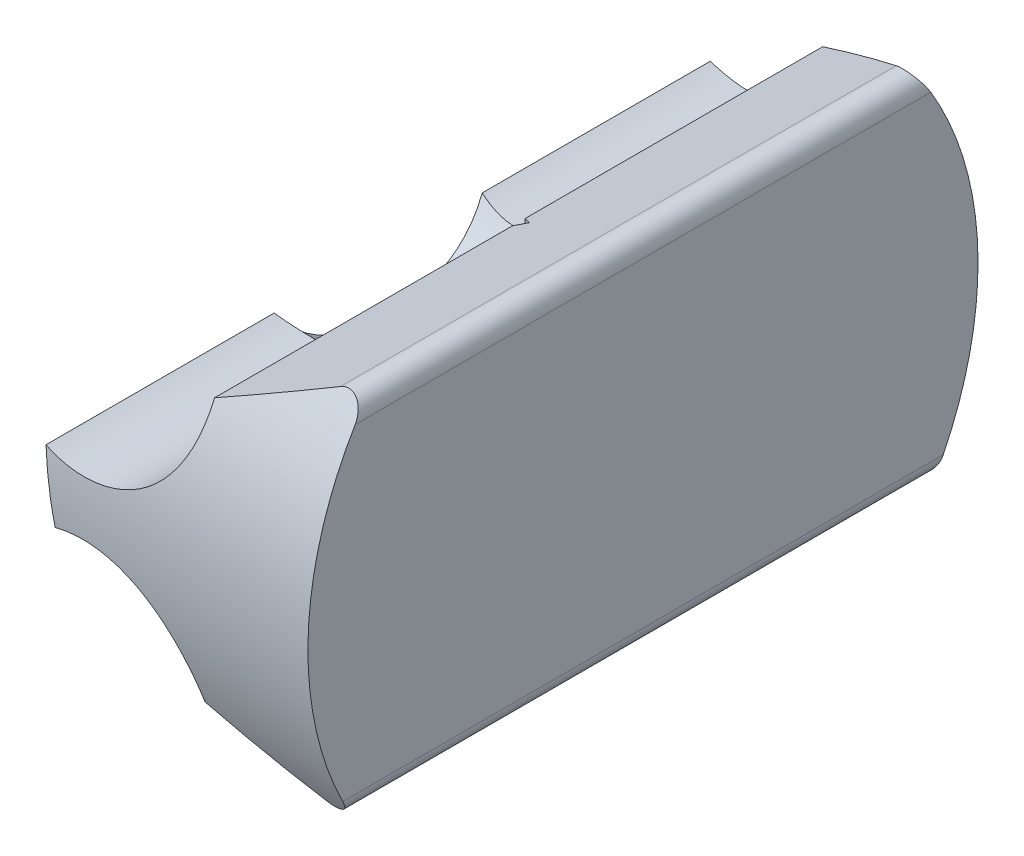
ISO-10303-21;
HEADER;
FILE_DESCRIPTION(('STEP AP214'),'2;1');
FILE_NAME('part.step','',(''),(''),'','','');
FILE_SCHEMA(('AUTOMOTIVE_DESIGN { 1 0 10303 214 1 1 1 1 }'));
ENDSEC;
DATA;
#1=APPLICATION_CONTEXT('core data for automotive mechanical design processes');
#2=APPLICATION_PROTOCOL_DEFINITION('international standard','automotive_design',2000,#1);
#3=PRODUCT_CONTEXT('',#1,'mechanical');
#4=PRODUCT('Part','Part','',(#3));
#5=PRODUCT_RELATED_PRODUCT_CATEGORY('part','',(#4));
#6=PRODUCT_DEFINITION_FORMATION('','',#4);
#7=PRODUCT_DEFINITION_CONTEXT('part definition',#1,'design');
#8=PRODUCT_DEFINITION('design','',#6,#7);
#9=PRODUCT_DEFINITION_SHAPE('','',#8);
#10=(LENGTH_UNIT() NAMED_UNIT(*) SI_UNIT(.MILLI.,.METRE.));
#11=(NAMED_UNIT(*) PLANE_ANGLE_UNIT() SI_UNIT($,.RADIAN.));
#12=(NAMED_UNIT(*) SI_UNIT($,.STERADIAN.) SOLID_ANGLE_UNIT());
#13=UNCERTAINTY_MEASURE_WITH_UNIT(LENGTH_MEASURE(1.E-05),#10,'distance_accuracy_value','');
#14=(GEOMETRIC_REPRESENTATION_CONTEXT(3) GLOBAL_UNCERTAINTY_ASSIGNED_CONTEXT((#13)) GLOBAL_UNIT_ASSIGNED_CONTEXT((#10,
#11,#12)) REPRESENTATION_CONTEXT('',''));
#15=CARTESIAN_POINT('',(0.,0.,0.));
#16=DIRECTION('',(0.,0.,1.));
#17=DIRECTION('',(1.,0.,0.));
#18=AXIS2_PLACEMENT_3D('',#15,#16,#17);
#19=CARTESIAN_POINT('',(-5.30753381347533,7.36767027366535,15.9004));
#20=DIRECTION('',(0.,0.,-1.));
#21=DIRECTION('',(-1.,0.,0.));
#22=AXIS2_PLACEMENT_3D('',#19,#20,#21);
#23=CYLINDRICAL_SURFACE('',#22,2.3876);
#24=CARTESIAN_POINT('',(-5.30753381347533,7.36767027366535,6.42568709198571));
#25=DIRECTION('',(-0.500000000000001,0.,0.866025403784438));
#26=DIRECTION('',(-0.866025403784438,0.,-0.500000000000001));
#27=AXIS2_PLACEMENT_3D('',#24,#25,#26);
#28=ELLIPSE('',#27,2.7569630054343,2.3876);
#29=CARTESIAN_POINT('',(-2.921,7.43901533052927,7.80355303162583));
#30=VERTEX_POINT('',#29);
#31=CARTESIAN_POINT('',(-3.24262217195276,6.16901533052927,7.61786438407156));
#32=VERTEX_POINT('',#31);
#33=EDGE_CURVE('E199',#30,#32,#28,.F.);
#34=ORIENTED_EDGE('',*,*,#33,.F.);
#35=DIRECTION('',(0.,0.,-1.));
#36=VECTOR('',#35,1.);
#37=CARTESIAN_POINT('',(-2.921,7.43901533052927,15.9004));
#38=LINE('',#37,#36);
#39=CARTESIAN_POINT('',(-2.921,7.43901533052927,0.804809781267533));
#40=VERTEX_POINT('',#39);
#41=EDGE_CURVE('E329',#30,#40,#38,.T.);
#42=ORIENTED_EDGE('',*,*,#41,.T.);
#43=CARTESIAN_POINT('',(-2.921,7.43901533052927,0.804809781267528));
#44=CARTESIAN_POINT('',(-2.9190773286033,7.37487343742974,0.775105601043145));
#45=CARTESIAN_POINT('',(-2.91973928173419,7.31025053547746,0.746245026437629));
#46=CARTESIAN_POINT('',(-2.92639874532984,7.18045659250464,0.690353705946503));
#47=CARTESIAN_POINT('',(-2.93239877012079,7.11528530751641,0.663323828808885));
#48=CARTESIAN_POINT('',(-2.94991961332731,6.98474457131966,0.6112148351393));
#49=CARTESIAN_POINT('',(-2.96145100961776,6.91937497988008,0.586139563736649));
#50=CARTESIAN_POINT('',(-2.99012885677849,6.78911750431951,0.538124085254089));
#51=CARTESIAN_POINT('',(-3.00727438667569,6.72422954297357,0.515183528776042));
#52=CARTESIAN_POINT('',(-3.06737791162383,6.53067027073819,0.449551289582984));
#53=CARTESIAN_POINT('',(-3.11896335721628,6.40340943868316,0.410170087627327));
#54=CARTESIAN_POINT('',(-3.24445110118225,6.15799910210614,0.340517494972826));
#55=CARTESIAN_POINT('',(-3.31831982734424,6.03983622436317,0.31023253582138));
#56=CARTESIAN_POINT('',(-3.48170703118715,5.82355993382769,0.259517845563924));
#57=CARTESIAN_POINT('',(-3.57006642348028,5.72468039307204,0.238617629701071));
#58=CARTESIAN_POINT('',(-3.76268103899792,5.54238833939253,0.203176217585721));
#59=CARTESIAN_POINT('',(-3.86694342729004,5.45898283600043,0.188637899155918));
#60=CARTESIAN_POINT('',(-4.08633290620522,5.31183913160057,0.164902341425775));
#61=CARTESIAN_POINT('',(-4.20123342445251,5.2477771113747,0.155614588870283));
#62=CARTESIAN_POINT('',(-4.44015951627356,5.13932893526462,0.14084260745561));
#63=CARTESIAN_POINT('',(-4.5641828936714,5.09493806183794,0.135357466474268));
#64=CARTESIAN_POINT('',(-4.81907695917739,5.02681537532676,0.127252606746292));
#65=CARTESIAN_POINT('',(-4.94999947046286,5.00327422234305,0.124659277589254));
#66=CARTESIAN_POINT('',(-5.21397208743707,4.97822078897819,0.121906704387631));
#67=CARTESIAN_POINT('',(-5.34702259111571,4.97671267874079,0.121747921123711));
#68=CARTESIAN_POINT('',(-5.6069494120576,4.99546699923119,0.123797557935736));
#69=CARTESIAN_POINT('',(-5.73387937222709,5.01497301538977,0.125923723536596));
#70=CARTESIAN_POINT('',(-5.92056800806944,5.05922220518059,0.131095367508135));
#71=CARTESIAN_POINT('',(-5.98221306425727,5.0764840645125,0.133151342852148));
#72=CARTESIAN_POINT('',(-6.10389867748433,5.11588782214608,0.138019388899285));
#73=CARTESIAN_POINT('',(-6.1639390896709,5.13803015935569,0.140831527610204));
#74=CARTESIAN_POINT('',(-6.223,5.16255,0.144068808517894));
#75=B_SPLINE_CURVE_WITH_KNOTS('',3,(#43,#44,#45,#46,#47,#48,#49,#50,#51,#52,#53,#54,#55,#56,#57,
#58,#59,#60,#61,#62,#63,#64,#65,#66,#67,#68,#69,#70,#71,#72,#73,#74),.UNSPECIFIED.,.F.,.F.,(4,2,
2,2,2,2,2,2,2,2,2,2,2,2,2,4),(0.,0.212099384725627,0.424298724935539,0.636905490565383,
0.84947739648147,1.2756020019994,1.70108778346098,2.10184436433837,2.50278204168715,
2.89657900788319,3.29028148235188,3.68754806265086,4.08488983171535,4.46839262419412,
4.66035751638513,4.85233967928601),.UNSPECIFIED.);
#76=CARTESIAN_POINT('',(-6.223,5.16255,0.144068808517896));
#77=VERTEX_POINT('',#76);
#78=EDGE_CURVE('E349',#40,#77,#75,.T.);
#79=ORIENTED_EDGE('',*,*,#78,.T.);
#80=DIRECTION('',(0.,0.,-1.));
#81=VECTOR('',#80,1.);
#82=CARTESIAN_POINT('',(-6.223,5.16255,15.9004));
#83=LINE('',#82,#81);
#84=CARTESIAN_POINT('',(-6.223,5.16255,5.50446606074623));
#85=VERTEX_POINT('',#84);
#86=EDGE_CURVE('E388',#85,#77,#83,.T.);
#87=ORIENTED_EDGE('',*,*,#86,.F.);
#88=CARTESIAN_POINT('',(-6.223,5.16255,5.50446606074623));
#89=CARTESIAN_POINT('',(-6.17077520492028,5.14087755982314,5.51803066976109));
#90=CARTESIAN_POINT('',(-6.11766868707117,5.12099924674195,5.53097756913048));
#91=CARTESIAN_POINT('',(-6.00975742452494,5.08495868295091,5.55512611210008));
#92=CARTESIAN_POINT('',(-5.95495083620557,5.06880063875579,5.56632577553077));
#93=CARTESIAN_POINT('',(-5.79145089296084,5.02698293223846,5.59591509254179));
#94=CARTESIAN_POINT('',(-5.68065673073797,5.0067223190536,5.61113189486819));
#95=CARTESIAN_POINT('',(-5.51820109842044,4.98883759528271,5.6247013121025));
#96=CARTESIAN_POINT('',(-5.46751934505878,4.98489231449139,5.62772612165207));
#97=CARTESIAN_POINT('',(-5.36589775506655,4.98024293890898,5.63129710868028));
#98=CARTESIAN_POINT('',(-5.31495788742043,4.97953924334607,5.63184298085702));
#99=CARTESIAN_POINT('',(-5.21189377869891,4.98141604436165,5.6303958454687));
#100=CARTESIAN_POINT('',(-5.15977207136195,4.98407982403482,5.6283384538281));
#101=CARTESIAN_POINT('',(-5.05596969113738,4.99278681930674,5.62170079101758));
#102=CARTESIAN_POINT('',(-5.00428904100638,4.99883020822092,5.61712039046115));
#103=CARTESIAN_POINT('',(-4.953,5.00653928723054,5.61134197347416));
#104=B_SPLINE_CURVE_WITH_KNOTS('',3,(#88,#89,#90,#91,#92,#93,#94,#95,#96,#97,#98,#99,#100,#101,
#102,#103),.UNSPECIFIED.,.F.,.F.,(4,2,2,2,2,2,2,4),(0.,0.174351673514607,0.348899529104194,
0.687967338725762,0.840615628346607,0.993282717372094,1.14980044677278,1.30632620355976),.UNSPECIFIED.);
#105=CARTESIAN_POINT('',(-4.953,5.00653928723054,5.6113419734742));
#106=VERTEX_POINT('',#105);
#107=EDGE_CURVE('E240',#85,#106,#104,.T.);
#108=ORIENTED_EDGE('',*,*,#107,.T.);
#109=DIRECTION('',(0.,0.,-1.));
#110=VECTOR('',#109,1.);
#111=CARTESIAN_POINT('',(-4.953,5.00653928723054,15.9004));
#112=LINE('',#111,#110);
#113=CARTESIAN_POINT('',(-4.953,5.00653928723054,10.2890580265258));
#114=VERTEX_POINT('',#113);
#115=EDGE_CURVE('E372',#114,#106,#112,.T.);
#116=ORIENTED_EDGE('',*,*,#115,.F.);
#117=CARTESIAN_POINT('',(-6.223,5.16255,10.3959339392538));
#118=CARTESIAN_POINT('',(-6.17077520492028,5.14087755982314,10.3823693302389));
#119=CARTESIAN_POINT('',(-6.11766868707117,5.12099924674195,10.3694224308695));
#120=CARTESIAN_POINT('',(-6.00975742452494,5.08495868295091,10.3452738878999));
#121=CARTESIAN_POINT('',(-5.95495083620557,5.06880063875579,10.3340742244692));
#122=CARTESIAN_POINT('',(-5.79145089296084,5.02698293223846,10.3044849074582));
#123=CARTESIAN_POINT('',(-5.68065673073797,5.0067223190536,10.2892681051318));
#124=CARTESIAN_POINT('',(-5.51820109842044,4.98883759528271,10.2756986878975));
#125=CARTESIAN_POINT('',(-5.46751934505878,4.98489231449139,10.2726738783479));
#126=CARTESIAN_POINT('',(-5.36589775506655,4.98024293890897,10.2691028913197));
#127=CARTESIAN_POINT('',(-5.31495788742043,4.97953924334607,10.268557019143));
#128=CARTESIAN_POINT('',(-5.21189377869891,4.98141604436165,10.2700041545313));
#129=CARTESIAN_POINT('',(-5.15977207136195,4.98407982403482,10.2720615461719));
#130=CARTESIAN_POINT('',(-5.05596969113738,4.99278681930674,10.2786992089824));
#131=CARTESIAN_POINT('',(-5.00428904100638,4.99883020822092,10.2832796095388));
#132=CARTESIAN_POINT('',(-4.953,5.00653928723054,10.2890580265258));
#133=B_SPLINE_CURVE_WITH_KNOTS('',3,(#117,#118,#119,#120,#121,#122,#123,#124,#125,#126,#127,
#128,#129,#130,#131,#132),.UNSPECIFIED.,.F.,.F.,(4,2,2,2,2,2,2,4),(0.,0.174351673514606,
0.348899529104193,0.687967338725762,0.840615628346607,0.993282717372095,1.14980044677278,
1.30632620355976),.UNSPECIFIED.);
#134=CARTESIAN_POINT('',(-6.223,5.16255,10.3959339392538));
#135=VERTEX_POINT('',#134);
#136=EDGE_CURVE('E247',#135,#114,#133,.T.);
#137=ORIENTED_EDGE('',*,*,#136,.F.);
#138=CARTESIAN_POINT('',(-6.223,5.16255,15.7563311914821));
#139=VERTEX_POINT('',#138);
#140=EDGE_CURVE('E385',#139,#135,#83,.T.);
#141=ORIENTED_EDGE('',*,*,#140,.F.);
#142=CARTESIAN_POINT('',(-2.921,7.43901533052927,15.0955902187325));
#143=CARTESIAN_POINT('',(-2.9190773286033,7.37487343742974,15.1252943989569));
#144=CARTESIAN_POINT('',(-2.91973928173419,7.31025053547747,15.1541549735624));
#145=CARTESIAN_POINT('',(-2.92639874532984,7.18045659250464,15.2100462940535));
#146=CARTESIAN_POINT('',(-2.93239877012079,7.11528530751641,15.2370761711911));
#147=CARTESIAN_POINT('',(-2.94991961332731,6.98474457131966,15.2891851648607));
#148=CARTESIAN_POINT('',(-2.96145100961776,6.91937497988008,15.3142604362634));
#149=CARTESIAN_POINT('',(-2.99012885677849,6.78911750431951,15.3622759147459));
#150=CARTESIAN_POINT('',(-3.00727438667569,6.72422954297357,15.385216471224));
#151=CARTESIAN_POINT('',(-3.06737791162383,6.53067027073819,15.450848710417));
#152=CARTESIAN_POINT('',(-3.11896335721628,6.40340943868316,15.4902299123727));
#153=CARTESIAN_POINT('',(-3.24445110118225,6.15799910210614,15.5598825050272));
#154=CARTESIAN_POINT('',(-3.31831982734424,6.03983622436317,15.5901674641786));
#155=CARTESIAN_POINT('',(-3.48170703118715,5.8235599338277,15.6408821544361));
#156=CARTESIAN_POINT('',(-3.57006642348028,5.72468039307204,15.6617823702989));
#157=CARTESIAN_POINT('',(-3.76268103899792,5.54238833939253,15.6972237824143));
#158=CARTESIAN_POINT('',(-3.86694342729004,5.45898283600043,15.7117621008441));
#159=CARTESIAN_POINT('',(-4.08633290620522,5.31183913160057,15.7354976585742));
#160=CARTESIAN_POINT('',(-4.20123342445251,5.2477771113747,15.7447854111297));
#161=CARTESIAN_POINT('',(-4.44015951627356,5.13932893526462,15.7595573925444));
#162=CARTESIAN_POINT('',(-4.5641828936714,5.09493806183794,15.7650425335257));
#163=CARTESIAN_POINT('',(-4.81907695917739,5.02681537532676,15.7731473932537));
#164=CARTESIAN_POINT('',(-4.94999947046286,5.00327422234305,15.7757407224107));
#165=CARTESIAN_POINT('',(-5.21397208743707,4.97822078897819,15.7784932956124));
#166=CARTESIAN_POINT('',(-5.34702259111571,4.97671267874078,15.7786520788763));
#167=CARTESIAN_POINT('',(-5.6069494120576,4.99546699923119,15.7766024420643));
#168=CARTESIAN_POINT('',(-5.73387937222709,5.01497301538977,15.7744762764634));
#169=CARTESIAN_POINT('',(-5.92056800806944,5.05922220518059,15.7693046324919));
#170=CARTESIAN_POINT('',(-5.98221306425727,5.0764840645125,15.7672486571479));
#171=CARTESIAN_POINT('',(-6.10389867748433,5.11588782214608,15.7623806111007));
#172=CARTESIAN_POINT('',(-6.1639390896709,5.13803015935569,15.7595684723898));
#173=CARTESIAN_POINT('',(-6.223,5.16255,15.7563311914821));
#174=B_SPLINE_CURVE_WITH_KNOTS('',3,(#142,#143,#144,#145,#146,#147,#148,#149,#150,#151,#152,
#153,#154,#155,#156,#157,#158,#159,#160,#161,#162,#163,#164,#165,#166,#167,#168,#169,#170,#171,
#172,#173),.UNSPECIFIED.,.F.,.F.,(4,2,2,2,2,2,2,2,2,2,2,2,2,2,2,4),(0.,0.212099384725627,
0.424298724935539,0.636905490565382,0.84947739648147,1.2756020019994,1.70108778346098,
2.10184436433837,2.50278204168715,2.89657900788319,3.29028148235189,3.68754806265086,
4.08488983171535,4.46839262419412,4.66035751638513,4.85233967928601),.UNSPECIFIED.);
#175=CARTESIAN_POINT('',(-2.921,7.43901533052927,15.0955902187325));
#176=VERTEX_POINT('',#175);
#177=EDGE_CURVE('E287',#176,#139,#174,.T.);
#178=ORIENTED_EDGE('',*,*,#177,.F.);
#179=CARTESIAN_POINT('',(-2.921,7.43901533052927,8.09684696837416));
#180=VERTEX_POINT('',#179);
#181=EDGE_CURVE('E330',#176,#180,#38,.T.);
#182=ORIENTED_EDGE('',*,*,#181,.T.);
#183=CARTESIAN_POINT('',(-5.30753381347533,7.36767027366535,9.47471290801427));
#184=DIRECTION('',(-0.499999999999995,0.,-0.866025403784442));
#185=DIRECTION('',(0.866025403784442,0.,-0.499999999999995));
#186=AXIS2_PLACEMENT_3D('',#183,#184,#185);
#187=ELLIPSE('',#186,2.75696300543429,2.3876);
#188=CARTESIAN_POINT('',(-3.24262217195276,6.16901533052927,8.28253561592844));
#189=VERTEX_POINT('',#188);
#190=EDGE_CURVE('E73',#189,#180,#187,.F.);
#191=ORIENTED_EDGE('',*,*,#190,.F.);
#192=DIRECTION('',(0.,0.,-1.));
#193=VECTOR('',#192,1.);
#194=CARTESIAN_POINT('',(-3.24262217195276,6.16901533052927,15.9004));
#195=LINE('',#194,#193);
#196=EDGE_CURVE('E13',#32,#189,#195,.F.);
#197=ORIENTED_EDGE('',*,*,#196,.F.);
#198=EDGE_LOOP('',(#34,#42,#79,#87,#108,#116,#137,#141,#178,#182,#191,#197));
#199=FACE_BOUND('',#198,.T.);
#200=ADVANCED_FACE('F58',(#199),#23,.F.);
#201=CARTESIAN_POINT('',(-0.578152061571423,8.53150326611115,15.9004));
#202=DIRECTION('',(0.422618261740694,-0.906307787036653,0.));
#203=DIRECTION('',(0.906307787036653,0.422618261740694,0.));
#204=AXIS2_PLACEMENT_3D('',#201,#202,#203);
#205=PLANE('',#204);
#206=DIRECTION('',(-0.803018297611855,-0.374453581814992,-0.463622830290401));
#207=VECTOR('',#206,1.);
#208=CARTESIAN_POINT('',(1.9326986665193,9.70233218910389,10.6058372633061));
#209=LINE('',#208,#207);
#210=CARTESIAN_POINT('',(-2.667,7.55745747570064,7.9502));
#211=VERTEX_POINT('',#210);
#212=EDGE_CURVE('E66',#211,#30,#209,.T.);
#213=ORIENTED_EDGE('',*,*,#212,.F.);
#214=DIRECTION('',(0.803018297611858,0.374453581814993,-0.463622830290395));
#215=VECTOR('',#214,1.);
#216=CARTESIAN_POINT('',(-3.98698234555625,6.94193959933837,8.71229216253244));
#217=LINE('',#216,#215);
#218=EDGE_CURVE('E186',#180,#211,#217,.T.);
#219=ORIENTED_EDGE('',*,*,#218,.F.);
#220=ORIENTED_EDGE('',*,*,#181,.F.);
#221=CARTESIAN_POINT('',(-10.0151619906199,4.13095326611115,7.9502));
#222=DIRECTION('',(0.422618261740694,-0.906307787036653,0.));
#223=DIRECTION('',(0.906307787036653,0.422618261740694,0.));
#224=AXIS2_PLACEMENT_3D('',#221,#222,#223);
#225=ELLIPSE('',#224,18.631471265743,7.874);
#226=CARTESIAN_POINT('',(-0.578152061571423,8.53150326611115,14.479750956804));
#227=VERTEX_POINT('',#226);
#228=EDGE_CURVE('E383',#227,#176,#225,.T.);
#229=ORIENTED_EDGE('',*,*,#228,.F.);
#230=DIRECTION('',(0.,0.,-1.));
#231=VECTOR('',#230,1.);
#232=CARTESIAN_POINT('',(-0.578152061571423,8.53150326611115,15.9004));
#233=LINE('',#232,#231);
#234=CARTESIAN_POINT('',(-0.578152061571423,8.53150326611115,1.42064904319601));
#235=VERTEX_POINT('',#234);
#236=EDGE_CURVE('E404',#227,#235,#233,.T.);
#237=ORIENTED_EDGE('',*,*,#236,.T.);
#238=CARTESIAN_POINT('',(-10.0151619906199,4.13095326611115,7.9502));
#239=DIRECTION('',(0.422618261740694,-0.906307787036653,0.));
#240=DIRECTION('',(0.906307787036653,0.422618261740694,0.));
#241=AXIS2_PLACEMENT_3D('',#238,#239,#240);
#242=ELLIPSE('',#241,18.631471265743,7.874);
#243=EDGE_CURVE('E381',#235,#40,#242,.F.);
#244=ORIENTED_EDGE('',*,*,#243,.T.);
#245=ORIENTED_EDGE('',*,*,#41,.F.);
#246=EDGE_LOOP('',(#213,#219,#220,#229,#237,#244,#245));
#247=FACE_BOUND('',#246,.T.);
#248=ADVANCED_FACE('F356',(#247),#205,.F.);
#249=CARTESIAN_POINT('',(-6.223,5.16255,15.9004));
#250=DIRECTION('',(0.984807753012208,0.17364817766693,0.));
#251=DIRECTION('',(-0.17364817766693,0.984807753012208,0.));
#252=AXIS2_PLACEMENT_3D('',#249,#250,#251);
#253=PLANE('',#252);
#254=CARTESIAN_POINT('',(-6.4368565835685,6.3753909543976,8.4582));
#255=DIRECTION('',(0.984807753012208,0.17364817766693,0.));
#256=DIRECTION('',(0.17364817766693,-0.984807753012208,0.));
#257=AXIS2_PLACEMENT_3D('',#254,#255,#256);
#258=ELLIPSE('',#257,2.32126523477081,2.286);
#259=CARTESIAN_POINT('',(-6.0438517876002,4.14655,8.9662));
#260=VERTEX_POINT('',#259);
#261=EDGE_CURVE('E376',#260,#135,#258,.F.);
#262=ORIENTED_EDGE('',*,*,#261,.F.);
#263=DIRECTION('',(0.17364817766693,-0.984807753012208,0.));
#264=VECTOR('',#263,1.);
#265=CARTESIAN_POINT('',(-6.223,5.16255,8.9662));
#266=LINE('',#265,#264);
#267=CARTESIAN_POINT('',(-5.9542776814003,3.63855,8.9662));
#268=VERTEX_POINT('',#267);
#269=EDGE_CURVE('E221',#260,#268,#266,.T.);
#270=ORIENTED_EDGE('',*,*,#269,.T.);
#271=DIRECTION('',(0.,0.,-1.));
#272=VECTOR('',#271,1.);
#273=CARTESIAN_POINT('',(-5.9542776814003,3.63855,15.9004));
#274=LINE('',#273,#272);
#275=CARTESIAN_POINT('',(-5.9542776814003,3.63855,15.8087886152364));
#276=VERTEX_POINT('',#275);
#277=EDGE_CURVE('E389',#276,#268,#274,.T.);
#278=ORIENTED_EDGE('',*,*,#277,.F.);
#279=CARTESIAN_POINT('',(-6.04110166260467,4.13095326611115,7.9502));
#280=DIRECTION('',(0.984807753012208,0.17364817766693,0.));
#281=DIRECTION('',(0.17364817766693,-0.984807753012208,0.));
#282=AXIS2_PLACEMENT_3D('',#279,#280,#281);
#283=ELLIPSE('',#282,7.99546914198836,7.874);
#284=EDGE_CURVE('E300',#139,#276,#283,.T.);
#285=ORIENTED_EDGE('',*,*,#284,.F.);
#286=ORIENTED_EDGE('',*,*,#140,.T.);
#287=EDGE_LOOP('',(#262,#270,#278,#285,#286));
#288=FACE_BOUND('',#287,.T.);
#289=ADVANCED_FACE('F359',(#288),#253,.F.);
#290=CARTESIAN_POINT('',(-5.9542776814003,3.63855,6.9342));
#291=VERTEX_POINT('',#290);
#292=CARTESIAN_POINT('',(-5.9542776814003,3.63855,0.0916113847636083));
#293=VERTEX_POINT('',#292);
#294=EDGE_CURVE('E392',#291,#293,#274,.T.);
#295=ORIENTED_EDGE('',*,*,#294,.F.);
#296=DIRECTION('',(-0.17364817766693,0.984807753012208,0.));
#297=VECTOR('',#296,1.);
#298=CARTESIAN_POINT('',(-6.223,5.16255,6.9342));
#299=LINE('',#298,#297);
#300=CARTESIAN_POINT('',(-6.0438517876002,4.14655,6.9342));
#301=VERTEX_POINT('',#300);
#302=EDGE_CURVE('E215',#291,#301,#299,.T.);
#303=ORIENTED_EDGE('',*,*,#302,.T.);
#304=CARTESIAN_POINT('',(-6.4368565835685,6.3753909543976,7.4422));
#305=DIRECTION('',(0.984807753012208,0.17364817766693,0.));
#306=DIRECTION('',(0.17364817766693,-0.984807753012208,0.));
#307=AXIS2_PLACEMENT_3D('',#304,#305,#306);
#308=ELLIPSE('',#307,2.32126523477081,2.286);
#309=EDGE_CURVE('E378',#301,#85,#308,.T.);
#310=ORIENTED_EDGE('',*,*,#309,.T.);
#311=ORIENTED_EDGE('',*,*,#86,.T.);
#312=CARTESIAN_POINT('',(-6.04110166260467,4.13095326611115,7.9502));
#313=DIRECTION('',(0.984807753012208,0.17364817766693,0.));
#314=DIRECTION('',(0.17364817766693,-0.984807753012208,0.));
#315=AXIS2_PLACEMENT_3D('',#312,#313,#314);
#316=ELLIPSE('',#315,7.99546914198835,7.874);
#317=EDGE_CURVE('E319',#77,#293,#316,.F.);
#318=ORIENTED_EDGE('',*,*,#317,.T.);
#319=EDGE_LOOP('',(#295,#303,#310,#311,#318));
#320=FACE_BOUND('',#319,.T.);
#321=ADVANCED_FACE('F306',(#320),#253,.F.);
#322=CARTESIAN_POINT('',(-5.30849731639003,1.33994140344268,15.9004));
#323=DIRECTION('',(0.,0.,-1.));
#324=DIRECTION('',(-1.,0.,0.));
#325=AXIS2_PLACEMENT_3D('',#322,#323,#324);
#326=CYLINDRICAL_SURFACE('',#325,2.3876);
#327=ORIENTED_EDGE('',*,*,#277,.T.);
#328=CARTESIAN_POINT('',(-5.30849731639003,1.33994140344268,8.9662));
#329=DIRECTION('',(0.,0.,1.));
#330=DIRECTION('',(1.,0.,0.));
#331=AXIS2_PLACEMENT_3D('',#328,#329,#330);
#332=CIRCLE('',#331,2.3876);
#333=CARTESIAN_POINT('',(-5.207,3.72538309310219,8.9662));
#334=VERTEX_POINT('',#333);
#335=EDGE_CURVE('E218',#268,#334,#332,.F.);
#336=ORIENTED_EDGE('',*,*,#335,.T.);
#337=DIRECTION('',(0.,0.,-1.));
#338=VECTOR('',#337,1.);
#339=CARTESIAN_POINT('',(-5.207,3.72538309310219,15.9004));
#340=LINE('',#339,#338);
#341=CARTESIAN_POINT('',(-5.207,3.72538309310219,6.9342));
#342=VERTEX_POINT('',#341);
#343=EDGE_CURVE('E209',#334,#342,#340,.T.);
#344=ORIENTED_EDGE('',*,*,#343,.T.);
#345=CARTESIAN_POINT('',(-5.30849731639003,1.33994140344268,6.9342));
#346=DIRECTION('',(0.,0.,-1.));
#347=DIRECTION('',(-1.,0.,0.));
#348=AXIS2_PLACEMENT_3D('',#345,#346,#347);
#349=CIRCLE('',#348,2.3876);
#350=EDGE_CURVE('E212',#342,#291,#349,.F.);
#351=ORIENTED_EDGE('',*,*,#350,.T.);
#352=ORIENTED_EDGE('',*,*,#294,.T.);
#353=CARTESIAN_POINT('',(-5.9542776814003,3.63855,0.0916113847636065));
#354=CARTESIAN_POINT('',(-5.88973412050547,3.65668280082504,0.090479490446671));
#355=CARTESIAN_POINT('',(-5.82445414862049,3.67208822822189,0.0895723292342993));
#356=CARTESIAN_POINT('',(-5.69283004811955,3.69735892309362,0.0881364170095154));
#357=CARTESIAN_POINT('',(-5.62648597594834,3.70722448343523,0.0876076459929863));
#358=CARTESIAN_POINT('',(-5.42666333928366,3.72836421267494,0.0864833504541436));
#359=CARTESIAN_POINT('',(-5.29219520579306,3.73123717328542,0.0863468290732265));
#360=CARTESIAN_POINT('',(-5.02469256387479,3.71440590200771,0.087222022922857));
#361=CARTESIAN_POINT('',(-4.89165870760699,3.69469180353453,0.0882342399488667));
#362=CARTESIAN_POINT('',(-4.63080213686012,3.63325843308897,0.0918849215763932));
#363=CARTESIAN_POINT('',(-4.50297842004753,3.59154341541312,0.0945230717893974));
#364=CARTESIAN_POINT('',(-4.25627470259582,3.48735422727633,0.102374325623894));
#365=CARTESIAN_POINT('',(-4.13738886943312,3.42489374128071,0.107585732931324));
#366=CARTESIAN_POINT('',(-3.91188548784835,3.28107247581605,0.121868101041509));
#367=CARTESIAN_POINT('',(-3.80526913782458,3.19970985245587,0.130939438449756));
#368=CARTESIAN_POINT('',(-3.60827368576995,3.02142031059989,0.154252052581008));
#369=CARTESIAN_POINT('',(-3.51776401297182,2.92463186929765,0.168448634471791));
#370=CARTESIAN_POINT('',(-3.35442391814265,2.71818154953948,0.203272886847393));
#371=CARTESIAN_POINT('',(-3.28158916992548,2.60852283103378,0.223898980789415));
#372=CARTESIAN_POINT('',(-3.15614457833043,2.38140665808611,0.27216162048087));
#373=CARTESIAN_POINT('',(-3.10330301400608,2.26405830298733,0.299711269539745));
#374=CARTESIAN_POINT('',(-3.0175048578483,2.02419003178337,0.362265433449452));
#375=CARTESIAN_POINT('',(-2.98454501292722,1.90167096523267,0.397268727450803));
#376=CARTESIAN_POINT('',(-2.94854374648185,1.70908001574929,0.457554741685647));
#377=CARTESIAN_POINT('',(-2.93872340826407,1.63943241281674,0.480421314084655));
#378=CARTESIAN_POINT('',(-2.92527820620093,1.50044220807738,0.528226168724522));
#379=CARTESIAN_POINT('',(-2.92163806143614,1.43109927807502,0.553159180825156));
#380=CARTESIAN_POINT('',(-2.92099999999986,1.36208466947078,0.579091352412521));
#381=B_SPLINE_CURVE_WITH_KNOTS('',3,(#353,#354,#355,#356,#357,#358,#359,#360,#361,#362,#363,
#364,#365,#366,#367,#368,#369,#370,#371,#372,#373,#374,#375,#376,#377,#378,#379,#380),
.UNSPECIFIED.,.F.,.F.,(4,2,2,2,2,2,2,2,2,2,2,2,2,4),(0.,0.201031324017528,0.402052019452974,
0.803480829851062,1.20508506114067,1.60661166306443,2.00787392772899,2.40917535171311,
2.80705855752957,3.20484427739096,3.59786711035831,3.99082561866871,4.21244794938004,
4.43352150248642),.UNSPECIFIED.);
#382=CARTESIAN_POINT('',(-2.921,1.36208466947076,0.57909135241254));
#383=VERTEX_POINT('',#382);
#384=EDGE_CURVE('E311',#293,#383,#381,.T.);
#385=ORIENTED_EDGE('',*,*,#384,.T.);
#386=DIRECTION('',(0.,0.,-1.));
#387=VECTOR('',#386,1.);
#388=CARTESIAN_POINT('',(-2.921,1.36208466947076,15.9004));
#389=LINE('',#388,#387);
#390=CARTESIAN_POINT('',(-2.921,1.36208466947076,15.3213086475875));
#391=VERTEX_POINT('',#390);
#392=EDGE_CURVE('E393',#391,#383,#389,.T.);
#393=ORIENTED_EDGE('',*,*,#392,.F.);
#394=CARTESIAN_POINT('',(-5.9542776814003,3.63855,15.8087886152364));
#395=CARTESIAN_POINT('',(-5.88973412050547,3.65668280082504,15.8099205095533));
#396=CARTESIAN_POINT('',(-5.82445414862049,3.67208822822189,15.8108276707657));
#397=CARTESIAN_POINT('',(-5.69283004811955,3.69735892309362,15.8122635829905));
#398=CARTESIAN_POINT('',(-5.62648597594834,3.70722448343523,15.812792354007));
#399=CARTESIAN_POINT('',(-5.42666333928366,3.72836421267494,15.8139166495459));
#400=CARTESIAN_POINT('',(-5.29219520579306,3.73123717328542,15.8140531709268));
#401=CARTESIAN_POINT('',(-5.02469256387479,3.71440590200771,15.8131779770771));
#402=CARTESIAN_POINT('',(-4.89165870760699,3.69469180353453,15.8121657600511));
#403=CARTESIAN_POINT('',(-4.63080213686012,3.63325843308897,15.8085150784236));
#404=CARTESIAN_POINT('',(-4.50297842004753,3.59154341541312,15.8058769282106));
#405=CARTESIAN_POINT('',(-4.25627470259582,3.48735422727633,15.7980256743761));
#406=CARTESIAN_POINT('',(-4.13738886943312,3.42489374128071,15.7928142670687));
#407=CARTESIAN_POINT('',(-3.91188548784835,3.28107247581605,15.7785318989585));
#408=CARTESIAN_POINT('',(-3.80526913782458,3.19970985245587,15.7694605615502));
#409=CARTESIAN_POINT('',(-3.60827368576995,3.02142031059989,15.746147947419));
#410=CARTESIAN_POINT('',(-3.51776401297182,2.92463186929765,15.7319513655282));
#411=CARTESIAN_POINT('',(-3.35442391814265,2.71818154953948,15.6971271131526));
#412=CARTESIAN_POINT('',(-3.28158916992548,2.60852283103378,15.6765010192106));
#413=CARTESIAN_POINT('',(-3.15614457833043,2.38140665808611,15.6282383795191));
#414=CARTESIAN_POINT('',(-3.10330301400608,2.26405830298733,15.6006887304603));
#415=CARTESIAN_POINT('',(-3.0175048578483,2.02419003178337,15.5381345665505));
#416=CARTESIAN_POINT('',(-2.98454501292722,1.90167096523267,15.5031312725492));
#417=CARTESIAN_POINT('',(-2.94854374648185,1.70908001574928,15.4428452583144));
#418=CARTESIAN_POINT('',(-2.93872340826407,1.63943241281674,15.4199786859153));
#419=CARTESIAN_POINT('',(-2.92527820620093,1.50044220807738,15.3721738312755));
#420=CARTESIAN_POINT('',(-2.92163806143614,1.43109927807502,15.3472408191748));
#421=CARTESIAN_POINT('',(-2.92099999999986,1.36208466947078,15.3213086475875));
#422=B_SPLINE_CURVE_WITH_KNOTS('',3,(#394,#395,#396,#397,#398,#399,#400,#401,#402,#403,#404,
#405,#406,#407,#408,#409,#410,#411,#412,#413,#414,#415,#416,#417,#418,#419,#420,#421),
.UNSPECIFIED.,.F.,.F.,(4,2,2,2,2,2,2,2,2,2,2,2,2,4),(0.,0.201031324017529,0.402052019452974,
0.803480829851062,1.20508506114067,1.60661166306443,2.00787392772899,2.40917535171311,
2.80705855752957,3.20484427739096,3.59786711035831,3.99082561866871,4.21244794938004,
4.43352150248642),.UNSPECIFIED.);
#423=EDGE_CURVE('E293',#276,#391,#422,.T.);
#424=ORIENTED_EDGE('',*,*,#423,.F.);
#425=EDGE_LOOP('',(#327,#336,#344,#351,#352,#385,#393,#424));
#426=FACE_BOUND('',#425,.T.);
#427=ADVANCED_FACE('F301',(#426),#326,.F.);
#428=CARTESIAN_POINT('',(-2.921,1.36208466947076,15.9004));
#429=DIRECTION('',(0.422618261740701,0.906307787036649,0.));
#430=DIRECTION('',(-0.906307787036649,0.422618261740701,0.));
#431=AXIS2_PLACEMENT_3D('',#428,#429,#430);
#432=PLANE('',#431);
#433=ORIENTED_EDGE('',*,*,#392,.T.);
#434=CARTESIAN_POINT('',(-8.85885786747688,4.13095326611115,7.9502));
#435=DIRECTION('',(0.422618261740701,0.906307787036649,0.));
#436=DIRECTION('',(0.906307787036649,-0.422618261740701,0.));
#437=AXIS2_PLACEMENT_3D('',#434,#435,#436);
#438=ELLIPSE('',#437,18.6314712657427,7.874);
#439=CARTESIAN_POINT('',(-0.578152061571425,0.269596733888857,1.08799906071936));
#440=VERTEX_POINT('',#439);
#441=EDGE_CURVE('E318',#383,#440,#438,.F.);
#442=ORIENTED_EDGE('',*,*,#441,.T.);
#443=DIRECTION('',(0.,0.,-1.));
#444=VECTOR('',#443,1.);
#445=CARTESIAN_POINT('',(-0.578152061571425,0.269596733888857,15.9004));
#446=LINE('',#445,#444);
#447=CARTESIAN_POINT('',(-0.578152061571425,0.269596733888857,14.8124009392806));
#448=VERTEX_POINT('',#447);
#449=EDGE_CURVE('E396',#448,#440,#446,.T.);
#450=ORIENTED_EDGE('',*,*,#449,.F.);
#451=CARTESIAN_POINT('',(-8.85885786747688,4.13095326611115,7.9502));
#452=DIRECTION('',(0.422618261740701,0.906307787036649,0.));
#453=DIRECTION('',(0.906307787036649,-0.422618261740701,0.));
#454=AXIS2_PLACEMENT_3D('',#451,#452,#453);
#455=ELLIPSE('',#454,18.6314712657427,7.874);
#456=EDGE_CURVE('E299',#391,#448,#455,.T.);
#457=ORIENTED_EDGE('',*,*,#456,.F.);
#458=EDGE_LOOP('',(#433,#442,#450,#457));
#459=FACE_BOUND('',#458,.T.);
#460=ADVANCED_FACE('F305',(#459),#432,.F.);
#461=CARTESIAN_POINT('',(-0.4064,0.637920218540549,15.9004));
#462=DIRECTION('',(0.,0.,-1.));
#463=DIRECTION('',(-1.,0.,0.));
#464=AXIS2_PLACEMENT_3D('',#461,#462,#463);
#465=CYLINDRICAL_SURFACE('',#464,0.4064);
#466=ORIENTED_EDGE('',*,*,#449,.T.);
#467=CARTESIAN_POINT('',(-0.578152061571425,0.269596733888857,1.08799906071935));
#468=CARTESIAN_POINT('',(-0.560199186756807,0.261199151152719,1.09272617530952));
#469=CARTESIAN_POINT('',(-0.54144470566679,0.254078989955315,1.09675136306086));
#470=CARTESIAN_POINT('',(-0.502844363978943,0.24262304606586,1.10324341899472));
#471=CARTESIAN_POINT('',(-0.482998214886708,0.238288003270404,1.10570987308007));
#472=CARTESIAN_POINT('',(-0.442690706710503,0.232630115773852,1.10893097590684));
#473=CARTESIAN_POINT('',(-0.422228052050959,0.231314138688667,1.1096817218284));
#474=CARTESIAN_POINT('',(-0.381369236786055,0.231778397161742,1.1094170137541));
#475=CARTESIAN_POINT('',(-0.360973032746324,0.233555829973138,1.10840315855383));
#476=CARTESIAN_POINT('',(-0.321343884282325,0.240026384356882,1.10472142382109));
#477=CARTESIAN_POINT('',(-0.302094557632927,0.244644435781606,1.10209613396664));
#478=CARTESIAN_POINT('',(-0.2646956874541,0.256519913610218,1.09537042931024));
#479=CARTESIAN_POINT('',(-0.246546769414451,0.263778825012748,1.09126918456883));
#480=CARTESIAN_POINT('',(-0.210970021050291,0.281022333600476,1.0815749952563));
#481=CARTESIAN_POINT('',(-0.193610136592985,0.291113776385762,1.07592383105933));
#482=CARTESIAN_POINT('',(-0.160836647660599,0.313491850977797,1.06347159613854));
#483=CARTESIAN_POINT('',(-0.145423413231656,0.325778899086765,1.05667030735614));
#484=CARTESIAN_POINT('',(-0.115184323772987,0.353628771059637,1.04136693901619));
#485=CARTESIAN_POINT('',(-0.100606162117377,0.369402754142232,1.03276024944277));
#486=CARTESIAN_POINT('',(-0.0742756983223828,0.402747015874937,1.01473219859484));
#487=CARTESIAN_POINT('',(-0.0625255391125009,0.420318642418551,1.00531022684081));
#488=CARTESIAN_POINT('',(-0.0407085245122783,0.459079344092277,0.984731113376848));
#489=CARTESIAN_POINT('',(-0.0310261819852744,0.48044757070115,0.973503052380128));
#490=CARTESIAN_POINT('',(-0.0155005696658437,0.524340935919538,0.950712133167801));
#491=CARTESIAN_POINT('',(-0.00965507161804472,0.546865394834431,0.939149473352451));
#492=CARTESIAN_POINT('',(-0.00193214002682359,0.592219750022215,0.916147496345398));
#493=CARTESIAN_POINT('',(2.39679148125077E-06,0.615040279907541,0.904708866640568));
#494=CARTESIAN_POINT('',(0.,0.637920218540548,0.893387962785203));
#495=B_SPLINE_CURVE_WITH_KNOTS('',3,(#467,#468,#469,#470,#471,#472,#473,#474,#475,#476,#477,
#478,#479,#480,#481,#482,#483,#484,#485,#486,#487,#488,#489,#490,#491,#492,#493,#494),
.UNSPECIFIED.,.F.,.F.,(4,2,2,2,2,2,2,2,2,2,2,2,2,4),(0.,0.0610889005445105,0.122194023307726,
0.183438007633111,0.244626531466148,0.304263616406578,0.363934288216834,0.426258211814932,
0.488593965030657,0.557732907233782,0.62692407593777,0.704621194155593,0.782273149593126,
0.858782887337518),.UNSPECIFIED.);
#496=CARTESIAN_POINT('',(0.,0.637920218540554,0.893387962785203));
#497=VERTEX_POINT('',#496);
#498=EDGE_CURVE('E323',#440,#497,#495,.T.);
#499=ORIENTED_EDGE('',*,*,#498,.T.);
#500=DIRECTION('',(0.,0.,-1.));
#501=VECTOR('',#500,1.);
#502=CARTESIAN_POINT('',(0.,0.637920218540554,15.9004));
#503=LINE('',#502,#501);
#504=CARTESIAN_POINT('',(0.,0.637920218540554,15.0070120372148));
#505=VERTEX_POINT('',#504);
#506=EDGE_CURVE('E399',#505,#497,#503,.T.);
#507=ORIENTED_EDGE('',*,*,#506,.F.);
#508=CARTESIAN_POINT('',(-0.578152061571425,0.269596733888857,14.8124009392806));
#509=CARTESIAN_POINT('',(-0.560199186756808,0.261199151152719,14.8076738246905));
#510=CARTESIAN_POINT('',(-0.54144470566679,0.254078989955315,14.8036486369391));
#511=CARTESIAN_POINT('',(-0.502844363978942,0.24262304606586,14.7971565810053));
#512=CARTESIAN_POINT('',(-0.482998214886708,0.238288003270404,14.7946901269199));
#513=CARTESIAN_POINT('',(-0.442690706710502,0.232630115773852,14.7914690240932));
#514=CARTESIAN_POINT('',(-0.422228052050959,0.231314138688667,14.7907182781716));
#515=CARTESIAN_POINT('',(-0.381369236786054,0.231778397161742,14.7909829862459));
#516=CARTESIAN_POINT('',(-0.360973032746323,0.233555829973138,14.7919968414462));
#517=CARTESIAN_POINT('',(-0.321343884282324,0.240026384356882,14.7956785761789));
#518=CARTESIAN_POINT('',(-0.302094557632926,0.244644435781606,14.7983038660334));
#519=CARTESIAN_POINT('',(-0.264695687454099,0.256519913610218,14.8050295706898));
#520=CARTESIAN_POINT('',(-0.24654676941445,0.263778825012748,14.8091308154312));
#521=CARTESIAN_POINT('',(-0.21097002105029,0.281022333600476,14.8188250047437));
#522=CARTESIAN_POINT('',(-0.193610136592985,0.291113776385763,14.8244761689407));
#523=CARTESIAN_POINT('',(-0.160836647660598,0.313491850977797,14.8369284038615));
#524=CARTESIAN_POINT('',(-0.145423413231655,0.325778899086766,14.8437296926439));
#525=CARTESIAN_POINT('',(-0.115184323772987,0.353628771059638,14.8590330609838));
#526=CARTESIAN_POINT('',(-0.100606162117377,0.369402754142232,14.8676397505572));
#527=CARTESIAN_POINT('',(-0.0742756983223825,0.402747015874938,14.8856678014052));
#528=CARTESIAN_POINT('',(-0.0625255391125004,0.420318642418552,14.8950897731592));
#529=CARTESIAN_POINT('',(-0.0407085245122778,0.459079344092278,14.9156688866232));
#530=CARTESIAN_POINT('',(-0.0310261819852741,0.48044757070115,14.9268969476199));
#531=CARTESIAN_POINT('',(-0.0155005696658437,0.524340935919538,14.9496878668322));
#532=CARTESIAN_POINT('',(-0.00965507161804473,0.546865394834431,14.9612505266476));
#533=CARTESIAN_POINT('',(-0.00193214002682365,0.592219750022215,14.9842525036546));
#534=CARTESIAN_POINT('',(2.39679148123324E-06,0.615040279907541,14.9956911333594));
#535=CARTESIAN_POINT('',(0.,0.637920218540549,15.0070120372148));
#536=B_SPLINE_CURVE_WITH_KNOTS('',3,(#508,#509,#510,#511,#512,#513,#514,#515,#516,#517,#518,
#519,#520,#521,#522,#523,#524,#525,#526,#527,#528,#529,#530,#531,#532,#533,#534,#535),
.UNSPECIFIED.,.F.,.F.,(4,2,2,2,2,2,2,2,2,2,2,2,2,4),(0.,0.0610889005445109,0.122194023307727,
0.183438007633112,0.244626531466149,0.304263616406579,0.363934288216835,0.426258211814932,
0.488593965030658,0.557732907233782,0.626924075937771,0.704621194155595,0.782273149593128,
0.858782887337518),.UNSPECIFIED.);
#537=EDGE_CURVE('E339',#448,#505,#536,.T.);
#538=ORIENTED_EDGE('',*,*,#537,.F.);
#539=EDGE_LOOP('',(#466,#499,#507,#538));
#540=FACE_BOUND('',#539,.T.);
#541=ADVANCED_FACE('F332',(#540),#465,.T.);
#542=CARTESIAN_POINT('',(0.,0.637920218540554,15.9004));
#543=DIRECTION('',(-1.,0.,0.));
#544=DIRECTION('',(0.,0.,1.));
#545=AXIS2_PLACEMENT_3D('',#542,#543,#544);
#546=PLANE('',#545);
#547=ORIENTED_EDGE('',*,*,#506,.T.);
#548=CARTESIAN_POINT('',(0.,4.13095326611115,7.9502));
#549=DIRECTION('',(-1.,0.,0.));
#550=DIRECTION('',(0.,0.,1.));
#551=AXIS2_PLACEMENT_3D('',#548,#549,#550);
#552=CIRCLE('',#551,7.874);
#553=CARTESIAN_POINT('',(0.,8.16317978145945,1.18698883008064));
#554=VERTEX_POINT('',#553);
#555=EDGE_CURVE('E432',#554,#497,#552,.T.);
#556=ORIENTED_EDGE('',*,*,#555,.F.);
#557=DIRECTION('',(0.,0.,-1.));
#558=VECTOR('',#557,1.);
#559=CARTESIAN_POINT('',(0.,8.16317978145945,15.9004));
#560=LINE('',#559,#558);
#561=CARTESIAN_POINT('',(0.,8.16317978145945,14.7134111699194));
#562=VERTEX_POINT('',#561);
#563=EDGE_CURVE('E402',#562,#554,#560,.T.);
#564=ORIENTED_EDGE('',*,*,#563,.F.);
#565=CARTESIAN_POINT('',(0.,4.13095326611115,7.9502));
#566=DIRECTION('',(1.,0.,0.));
#567=DIRECTION('',(0.,0.,-1.));
#568=AXIS2_PLACEMENT_3D('',#565,#566,#567);
#569=CIRCLE('',#568,7.874);
#570=EDGE_CURVE('E433',#562,#505,#569,.T.);
#571=ORIENTED_EDGE('',*,*,#570,.T.);
#572=EDGE_LOOP('',(#547,#556,#564,#571));
#573=FACE_BOUND('',#572,.T.);
#574=ADVANCED_FACE('F336',(#573),#546,.F.);
#575=CARTESIAN_POINT('',(-0.4064,8.16317978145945,15.9004));
#576=DIRECTION('',(0.,0.,-1.));
#577=DIRECTION('',(-1.,0.,0.));
#578=AXIS2_PLACEMENT_3D('',#575,#576,#577);
#579=CYLINDRICAL_SURFACE('',#578,0.4064);
#580=ORIENTED_EDGE('',*,*,#563,.T.);
#581=CARTESIAN_POINT('',(0.,8.16317978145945,1.18698883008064));
#582=CARTESIAN_POINT('',(-2.61950470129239E-06,8.19286762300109,1.20467519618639));
#583=CARTESIAN_POINT('',(-0.00325372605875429,8.22245150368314,1.22259108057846));
#584=CARTESIAN_POINT('',(-0.0161713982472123,8.28054381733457,1.25827245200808));
#585=CARTESIAN_POINT('',(-0.0258785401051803,8.30904423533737,1.2760362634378));
#586=CARTESIAN_POINT('',(-0.0502146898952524,8.36070696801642,1.3086714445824));
#587=CARTESIAN_POINT('',(-0.0641885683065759,8.3841121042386,1.32364657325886));
#588=CARTESIAN_POINT('',(-0.0970358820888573,8.42814165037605,1.35211481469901));
#589=CARTESIAN_POINT('',(-0.115891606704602,8.44877571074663,1.36561303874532));
#590=CARTESIAN_POINT('',(-0.152552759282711,8.48122140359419,1.38702122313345));
#591=CARTESIAN_POINT('',(-0.169276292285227,8.49391316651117,1.39545768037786));
#592=CARTESIAN_POINT('',(-0.205015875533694,8.51681086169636,1.41075672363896));
#593=CARTESIAN_POINT('',(-0.224031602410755,8.52701714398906,1.41761953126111));
#594=CARTESIAN_POINT('',(-0.26411675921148,8.54449017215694,1.42941162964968));
#595=CARTESIAN_POINT('',(-0.285199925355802,8.55173533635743,1.43432671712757));
#596=CARTESIAN_POINT('',(-0.328656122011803,8.56270109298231,1.441779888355));
#597=CARTESIAN_POINT('',(-0.351027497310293,8.56642610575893,1.44432095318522));
#598=CARTESIAN_POINT('',(-0.393399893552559,8.56985736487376,1.44666175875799));
#599=CARTESIAN_POINT('',(-0.413349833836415,8.57000565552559,1.44676302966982));
#600=CARTESIAN_POINT('',(-0.452982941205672,8.5673890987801,1.44497782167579));
#601=CARTESIAN_POINT('',(-0.472665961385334,8.56462270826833,1.44309028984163));
#602=CARTESIAN_POINT('',(-0.506980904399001,8.55723909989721,1.43806634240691));
#603=CARTESIAN_POINT('',(-0.521784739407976,8.5531514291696,1.43528822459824));
#604=CARTESIAN_POINT('',(-0.550601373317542,8.54344114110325,1.42870787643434));
#605=CARTESIAN_POINT('',(-0.564616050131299,8.53782237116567,1.42490821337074));
#606=CARTESIAN_POINT('',(-0.578152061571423,8.53150326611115,1.420649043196));
#607=B_SPLINE_CURVE_WITH_KNOTS('',3,(#581,#582,#583,#584,#585,#586,#587,#588,#589,#590,#591,
#592,#593,#594,#595,#596,#597,#598,#599,#600,#601,#602,#603,#604,#605,#606),.UNSPECIFIED.,.F.,
.F.,(4,2,2,2,2,2,2,2,2,2,2,2,4),(0.,0.103575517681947,0.207808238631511,0.30063052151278,
0.393120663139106,0.460730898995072,0.528331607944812,0.596416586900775,0.664415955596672,
0.723961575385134,0.783538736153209,0.830233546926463,0.876812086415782),.UNSPECIFIED.);
#608=EDGE_CURVE('E344',#554,#235,#607,.T.);
#609=ORIENTED_EDGE('',*,*,#608,.T.);
#610=ORIENTED_EDGE('',*,*,#236,.F.);
#611=CARTESIAN_POINT('',(0.,8.16317978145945,14.7134111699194));
#612=CARTESIAN_POINT('',(-2.61950470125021E-06,8.19286762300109,14.6957248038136));
#613=CARTESIAN_POINT('',(-0.00325372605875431,8.22245150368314,14.6778089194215));
#614=CARTESIAN_POINT('',(-0.0161713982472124,8.28054381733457,14.6421275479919));
#615=CARTESIAN_POINT('',(-0.0258785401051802,8.30904423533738,14.6243637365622));
#616=CARTESIAN_POINT('',(-0.0502146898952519,8.36070696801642,14.5917285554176));
#617=CARTESIAN_POINT('',(-0.0641885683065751,8.3841121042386,14.5767534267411));
#618=CARTESIAN_POINT('',(-0.0970358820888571,8.42814165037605,14.548285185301));
#619=CARTESIAN_POINT('',(-0.115891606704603,8.44877571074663,14.5347869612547));
#620=CARTESIAN_POINT('',(-0.152552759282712,8.48122140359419,14.5133787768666));
#621=CARTESIAN_POINT('',(-0.169276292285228,8.49391316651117,14.5049423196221));
#622=CARTESIAN_POINT('',(-0.205015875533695,8.51681086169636,14.489643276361));
#623=CARTESIAN_POINT('',(-0.224031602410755,8.52701714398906,14.4827804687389));
#624=CARTESIAN_POINT('',(-0.264116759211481,8.54449017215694,14.4709883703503));
#625=CARTESIAN_POINT('',(-0.285199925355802,8.55173533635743,14.4660732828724));
#626=CARTESIAN_POINT('',(-0.328656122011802,8.56270109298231,14.458620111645));
#627=CARTESIAN_POINT('',(-0.351027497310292,8.56642610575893,14.4560790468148));
#628=CARTESIAN_POINT('',(-0.393399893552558,8.56985736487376,14.453738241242));
#629=CARTESIAN_POINT('',(-0.413349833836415,8.57000565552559,14.4536369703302));
#630=CARTESIAN_POINT('',(-0.452982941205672,8.5673890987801,14.4554221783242));
#631=CARTESIAN_POINT('',(-0.472665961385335,8.56462270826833,14.4573097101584));
#632=CARTESIAN_POINT('',(-0.506980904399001,8.55723909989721,14.4623336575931));
#633=CARTESIAN_POINT('',(-0.521784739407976,8.5531514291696,14.4651117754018));
#634=CARTESIAN_POINT('',(-0.550601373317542,8.54344114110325,14.4716921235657));
#635=CARTESIAN_POINT('',(-0.564616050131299,8.53782237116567,14.4754917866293));
#636=CARTESIAN_POINT('',(-0.578152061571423,8.53150326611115,14.479750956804));
#637=B_SPLINE_CURVE_WITH_KNOTS('',3,(#611,#612,#613,#614,#615,#616,#617,#618,#619,#620,#621,
#622,#623,#624,#625,#626,#627,#628,#629,#630,#631,#632,#633,#634,#635,#636),.UNSPECIFIED.,.F.,
.F.,(4,2,2,2,2,2,2,2,2,2,2,2,4),(0.,0.103575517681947,0.20780823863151,0.30063052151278,
0.393120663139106,0.460730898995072,0.528331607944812,0.596416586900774,0.664415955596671,
0.723961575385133,0.783538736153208,0.830233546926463,0.876812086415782),.UNSPECIFIED.);
#638=EDGE_CURVE('E278',#562,#227,#637,.T.);
#639=ORIENTED_EDGE('',*,*,#638,.F.);
#640=EDGE_LOOP('',(#580,#609,#610,#639));
#641=FACE_BOUND('',#640,.T.);
#642=ADVANCED_FACE('F271',(#641),#579,.T.);
#643=CARTESIAN_POINT('',(-15.9004,4.13095326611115,7.9502));
#644=DIRECTION('',(1.,0.,0.));
#645=DIRECTION('',(0.,0.,-1.));
#646=AXIS2_PLACEMENT_3D('',#643,#644,#645);
#647=CYLINDRICAL_SURFACE('',#646,7.874);
#648=ORIENTED_EDGE('',*,*,#537,.T.);
#649=ORIENTED_EDGE('',*,*,#570,.F.);
#650=ORIENTED_EDGE('',*,*,#638,.T.);
#651=ORIENTED_EDGE('',*,*,#228,.T.);
#652=ORIENTED_EDGE('',*,*,#177,.T.);
#653=ORIENTED_EDGE('',*,*,#284,.T.);
#654=ORIENTED_EDGE('',*,*,#423,.T.);
#655=ORIENTED_EDGE('',*,*,#456,.T.);
#656=EDGE_LOOP('',(#648,#649,#650,#651,#652,#653,#654,#655));
#657=FACE_BOUND('',#656,.T.);
#658=ADVANCED_FACE('F266',(#657),#647,.T.);
#659=CARTESIAN_POINT('',(-15.9004,4.13095326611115,7.9502));
#660=DIRECTION('',(1.,0.,0.));
#661=DIRECTION('',(0.,0.,-1.));
#662=AXIS2_PLACEMENT_3D('',#659,#660,#661);
#663=CYLINDRICAL_SURFACE('',#662,7.874);
#664=ORIENTED_EDGE('',*,*,#441,.F.);
#665=ORIENTED_EDGE('',*,*,#384,.F.);
#666=ORIENTED_EDGE('',*,*,#317,.F.);
#667=ORIENTED_EDGE('',*,*,#78,.F.);
#668=ORIENTED_EDGE('',*,*,#243,.F.);
#669=ORIENTED_EDGE('',*,*,#608,.F.);
#670=ORIENTED_EDGE('',*,*,#555,.T.);
#671=ORIENTED_EDGE('',*,*,#498,.F.);
#672=EDGE_LOOP('',(#664,#665,#666,#667,#668,#669,#670,#671));
#673=FACE_BOUND('',#672,.T.);
#674=ADVANCED_FACE('F270',(#673),#663,.T.);
#675=CARTESIAN_POINT('',(-4.953,6.3753909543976,8.4582));
#676=DIRECTION('',(-1.,0.,0.));
#677=DIRECTION('',(0.,0.,1.));
#678=AXIS2_PLACEMENT_3D('',#675,#676,#677);
#679=PLANE('',#678);
#680=ORIENTED_EDGE('',*,*,#115,.T.);
#681=CARTESIAN_POINT('',(-4.953,6.3753909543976,7.4422));
#682=DIRECTION('',(1.,0.,0.));
#683=DIRECTION('',(0.,0.,-1.));
#684=AXIS2_PLACEMENT_3D('',#681,#682,#683);
#685=CIRCLE('',#684,2.286);
#686=CARTESIAN_POINT('',(-4.953,4.14655,6.9342));
#687=VERTEX_POINT('',#686);
#688=EDGE_CURVE('E227',#687,#106,#685,.T.);
#689=ORIENTED_EDGE('',*,*,#688,.F.);
#690=DIRECTION('',(0.,0.,-1.));
#691=VECTOR('',#690,1.);
#692=CARTESIAN_POINT('',(-4.953,4.14655,8.9662));
#693=LINE('',#692,#691);
#694=CARTESIAN_POINT('',(-4.953,4.14655,8.9662));
#695=VERTEX_POINT('',#694);
#696=EDGE_CURVE('E230',#695,#687,#693,.T.);
#697=ORIENTED_EDGE('',*,*,#696,.F.);
#698=CARTESIAN_POINT('',(-4.953,6.3753909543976,8.4582));
#699=DIRECTION('',(-1.,0.,0.));
#700=DIRECTION('',(0.,0.,1.));
#701=AXIS2_PLACEMENT_3D('',#698,#699,#700);
#702=CIRCLE('',#701,2.286);
#703=EDGE_CURVE('E224',#695,#114,#702,.T.);
#704=ORIENTED_EDGE('',*,*,#703,.T.);
#705=EDGE_LOOP('',(#680,#689,#697,#704));
#706=FACE_BOUND('',#705,.T.);
#707=ADVANCED_FACE('F264',(#706),#679,.T.);
#708=CARTESIAN_POINT('',(-6.37544519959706,6.3753909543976,8.4582));
#709=DIRECTION('',(1.,0.,0.));
#710=DIRECTION('',(0.,0.,-1.));
#711=AXIS2_PLACEMENT_3D('',#708,#709,#710);
#712=CYLINDRICAL_SURFACE('',#711,2.286);
#713=ORIENTED_EDGE('',*,*,#136,.T.);
#714=ORIENTED_EDGE('',*,*,#703,.F.);
#715=DIRECTION('',(1.,0.,0.));
#716=VECTOR('',#715,1.);
#717=CARTESIAN_POINT('',(-6.37544519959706,4.14655,8.9662));
#718=LINE('',#717,#716);
#719=CARTESIAN_POINT('',(-5.207,4.14655,8.9662));
#720=VERTEX_POINT('',#719);
#721=EDGE_CURVE('E233',#720,#695,#718,.T.);
#722=ORIENTED_EDGE('',*,*,#721,.F.);
#723=EDGE_CURVE('E234',#260,#720,#718,.T.);
#724=ORIENTED_EDGE('',*,*,#723,.F.);
#725=ORIENTED_EDGE('',*,*,#261,.T.);
#726=EDGE_LOOP('',(#713,#714,#722,#724,#725));
#727=FACE_BOUND('',#726,.T.);
#728=ADVANCED_FACE('F258',(#727),#712,.F.);
#729=CARTESIAN_POINT('',(-6.37544519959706,6.3753909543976,7.4422));
#730=DIRECTION('',(1.,0.,0.));
#731=DIRECTION('',(0.,0.,-1.));
#732=AXIS2_PLACEMENT_3D('',#729,#730,#731);
#733=CYLINDRICAL_SURFACE('',#732,2.286);
#734=ORIENTED_EDGE('',*,*,#309,.F.);
#735=DIRECTION('',(1.,0.,0.));
#736=VECTOR('',#735,1.);
#737=CARTESIAN_POINT('',(-6.37544519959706,4.14655,6.9342));
#738=LINE('',#737,#736);
#739=CARTESIAN_POINT('',(-5.207,4.14655,6.9342));
#740=VERTEX_POINT('',#739);
#741=EDGE_CURVE('E237',#301,#740,#738,.T.);
#742=ORIENTED_EDGE('',*,*,#741,.T.);
#743=EDGE_CURVE('E236',#740,#687,#738,.T.);
#744=ORIENTED_EDGE('',*,*,#743,.T.);
#745=ORIENTED_EDGE('',*,*,#688,.T.);
#746=ORIENTED_EDGE('',*,*,#107,.F.);
#747=EDGE_LOOP('',(#734,#742,#744,#745,#746));
#748=FACE_BOUND('',#747,.T.);
#749=ADVANCED_FACE('F253',(#748),#733,.F.);
#750=CARTESIAN_POINT('',(-6.37544519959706,4.14655,8.9662));
#751=DIRECTION('',(0.,-1.,0.));
#752=DIRECTION('',(0.,0.,-1.));
#753=AXIS2_PLACEMENT_3D('',#750,#751,#752);
#754=PLANE('',#753);
#755=ORIENTED_EDGE('',*,*,#743,.F.);
#756=DIRECTION('',(0.,0.,-1.));
#757=VECTOR('',#756,1.);
#758=CARTESIAN_POINT('',(-5.207,4.14655,8.9662));
#759=LINE('',#758,#757);
#760=EDGE_CURVE('E207',#720,#740,#759,.T.);
#761=ORIENTED_EDGE('',*,*,#760,.F.);
#762=ORIENTED_EDGE('',*,*,#721,.T.);
#763=ORIENTED_EDGE('',*,*,#696,.T.);
#764=EDGE_LOOP('',(#755,#761,#762,#763));
#765=FACE_BOUND('',#764,.T.);
#766=ADVANCED_FACE('F257',(#765),#754,.F.);
#767=CARTESIAN_POINT('',(-6.37544519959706,4.14655,8.9662));
#768=DIRECTION('',(0.,0.,1.));
#769=DIRECTION('',(1.,0.,0.));
#770=AXIS2_PLACEMENT_3D('',#767,#768,#769);
#771=PLANE('',#770);
#772=ORIENTED_EDGE('',*,*,#723,.T.);
#773=DIRECTION('',(0.,-1.,0.));
#774=VECTOR('',#773,1.);
#775=CARTESIAN_POINT('',(-5.207,4.14655,8.9662));
#776=LINE('',#775,#774);
#777=EDGE_CURVE('E81',#720,#334,#776,.T.);
#778=ORIENTED_EDGE('',*,*,#777,.T.);
#779=ORIENTED_EDGE('',*,*,#335,.F.);
#780=ORIENTED_EDGE('',*,*,#269,.F.);
#781=EDGE_LOOP('',(#772,#778,#779,#780));
#782=FACE_BOUND('',#781,.T.);
#783=ADVANCED_FACE('F446',(#782),#771,.F.);
#784=CARTESIAN_POINT('',(-6.37544519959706,3.63855,6.9342));
#785=DIRECTION('',(0.,0.,-1.));
#786=DIRECTION('',(-1.,0.,0.));
#787=AXIS2_PLACEMENT_3D('',#784,#785,#786);
#788=PLANE('',#787);
#789=ORIENTED_EDGE('',*,*,#350,.F.);
#790=DIRECTION('',(0.,1.,0.));
#791=VECTOR('',#790,1.);
#792=CARTESIAN_POINT('',(-5.207,3.63855,6.9342));
#793=LINE('',#792,#791);
#794=EDGE_CURVE('E205',#342,#740,#793,.T.);
#795=ORIENTED_EDGE('',*,*,#794,.T.);
#796=ORIENTED_EDGE('',*,*,#741,.F.);
#797=ORIENTED_EDGE('',*,*,#302,.F.);
#798=EDGE_LOOP('',(#789,#795,#796,#797));
#799=FACE_BOUND('',#798,.T.);
#800=ADVANCED_FACE('F450',(#799),#788,.F.);
#801=CARTESIAN_POINT('',(-5.207,0.,0.));
#802=DIRECTION('',(1.,0.,0.));
#803=DIRECTION('',(0.,0.,-1.));
#804=AXIS2_PLACEMENT_3D('',#801,#802,#803);
#805=PLANE('',#804);
#806=ORIENTED_EDGE('',*,*,#777,.F.);
#807=ORIENTED_EDGE('',*,*,#760,.T.);
#808=ORIENTED_EDGE('',*,*,#794,.F.);
#809=ORIENTED_EDGE('',*,*,#343,.F.);
#810=EDGE_LOOP('',(#806,#807,#808,#809));
#811=FACE_BOUND('',#810,.T.);
#812=ADVANCED_FACE('F448',(#811),#805,.F.);
#813=CARTESIAN_POINT('',(0.,6.16901533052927,0.));
#814=DIRECTION('',(0.,1.,0.));
#815=DIRECTION('',(0.,0.,1.));
#816=AXIS2_PLACEMENT_3D('',#813,#814,#815);
#817=PLANE('',#816);
#818=ORIENTED_EDGE('',*,*,#196,.T.);
#819=DIRECTION('',(0.866025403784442,0.,-0.499999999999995));
#820=VECTOR('',#819,1.);
#821=CARTESIAN_POINT('',(-4.191,6.16901533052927,8.83008181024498));
#822=LINE('',#821,#820);
#823=CARTESIAN_POINT('',(-2.667,6.16901533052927,7.9502));
#824=VERTEX_POINT('',#823);
#825=EDGE_CURVE('E185',#189,#824,#822,.T.);
#826=ORIENTED_EDGE('',*,*,#825,.T.);
#827=DIRECTION('',(-0.866025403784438,0.,-0.500000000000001));
#828=VECTOR('',#827,1.);
#829=CARTESIAN_POINT('',(-2.667,6.16901533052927,7.9502));
#830=LINE('',#829,#828);
#831=EDGE_CURVE('E194',#824,#32,#830,.T.);
#832=ORIENTED_EDGE('',*,*,#831,.T.);
#833=EDGE_LOOP('',(#818,#826,#832));
#834=FACE_BOUND('',#833,.T.);
#835=ADVANCED_FACE('F193',(#834),#817,.T.);
#836=CARTESIAN_POINT('',(-2.667,19.5294153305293,7.9502));
#837=DIRECTION('',(-0.500000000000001,0.,0.866025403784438));
#838=DIRECTION('',(0.866025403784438,0.,0.500000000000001));
#839=AXIS2_PLACEMENT_3D('',#836,#837,#838);
#840=PLANE('',#839);
#841=ORIENTED_EDGE('',*,*,#33,.T.);
#842=ORIENTED_EDGE('',*,*,#831,.F.);
#843=DIRECTION('',(0.,-1.,0.));
#844=VECTOR('',#843,1.);
#845=CARTESIAN_POINT('',(-2.667,19.5294153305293,7.9502));
#846=LINE('',#845,#844);
#847=EDGE_CURVE('E182',#211,#824,#846,.T.);
#848=ORIENTED_EDGE('',*,*,#847,.F.);
#849=ORIENTED_EDGE('',*,*,#212,.T.);
#850=EDGE_LOOP('',(#841,#842,#848,#849));
#851=FACE_BOUND('',#850,.T.);
#852=ADVANCED_FACE('F197',(#851),#840,.T.);
#853=CARTESIAN_POINT('',(-4.191,19.5294153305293,8.83008181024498));
#854=DIRECTION('',(-0.499999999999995,0.,-0.866025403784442));
#855=DIRECTION('',(-0.866025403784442,0.,0.499999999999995));
#856=AXIS2_PLACEMENT_3D('',#853,#854,#855);
#857=PLANE('',#856);
#858=ORIENTED_EDGE('',*,*,#190,.T.);
#859=ORIENTED_EDGE('',*,*,#218,.T.);
#860=ORIENTED_EDGE('',*,*,#847,.T.);
#861=ORIENTED_EDGE('',*,*,#825,.F.);
#862=EDGE_LOOP('',(#858,#859,#860,#861));
#863=FACE_BOUND('',#862,.T.);
#864=ADVANCED_FACE('F184',(#863),#857,.T.);
#865=CLOSED_SHELL('',(#200,#248,#289,#321,#427,#460,#541,#574,#642,#658,#674,#707,#728,#749,
#766,#783,#800,#812,#835,#852,#864));
#866=MANIFOLD_SOLID_BREP('B2',#865);
#867=ADVANCED_BREP_SHAPE_REPRESENTATION('',(#18,#866),#14);
#868=SHAPE_DEFINITION_REPRESENTATION(#9,#867);
ENDSEC;
END-ISO-10303-21;
